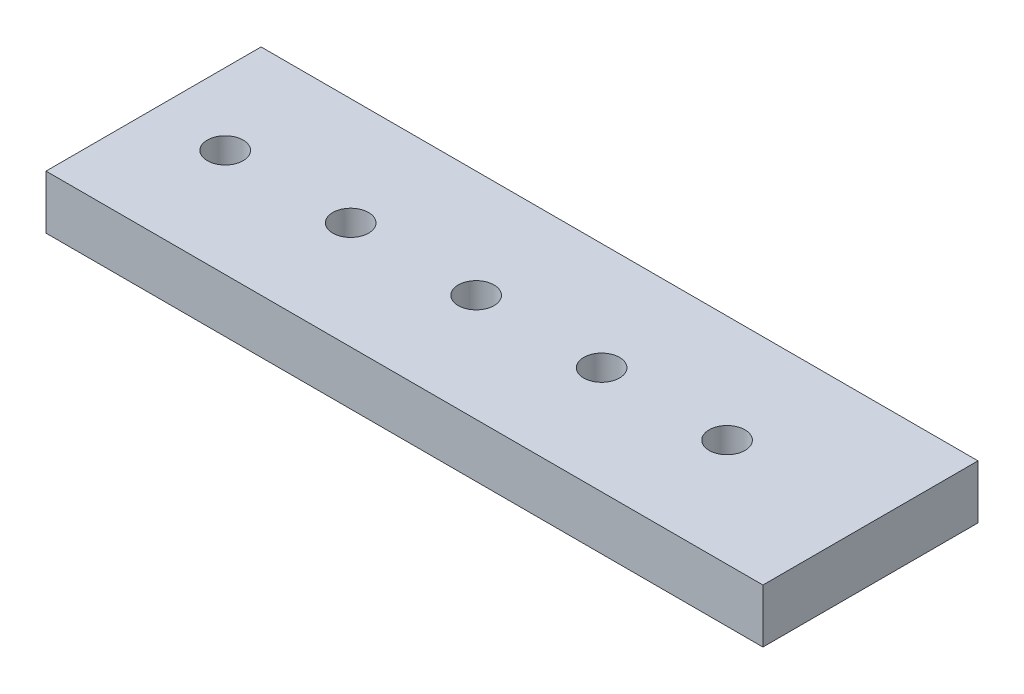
ISO-10303-21;
HEADER;
FILE_DESCRIPTION(('STEP AP214'),'2;1');
FILE_NAME('part.step','',(''),(''),'','','');
FILE_SCHEMA(('AUTOMOTIVE_DESIGN { 1 0 10303 214 1 1 1 1 }'));
ENDSEC;
DATA;
#1=APPLICATION_CONTEXT('core data for automotive mechanical design processes');
#2=APPLICATION_PROTOCOL_DEFINITION('international standard','automotive_design',2000,#1);
#3=PRODUCT_CONTEXT('',#1,'mechanical');
#4=PRODUCT('Part','Part','',(#3));
#5=PRODUCT_RELATED_PRODUCT_CATEGORY('part','',(#4));
#6=PRODUCT_DEFINITION_FORMATION('','',#4);
#7=PRODUCT_DEFINITION_CONTEXT('part definition',#1,'design');
#8=PRODUCT_DEFINITION('design','',#6,#7);
#9=PRODUCT_DEFINITION_SHAPE('','',#8);
#10=(LENGTH_UNIT() NAMED_UNIT(*) SI_UNIT(.MILLI.,.METRE.));
#11=(NAMED_UNIT(*) PLANE_ANGLE_UNIT() SI_UNIT($,.RADIAN.));
#12=(NAMED_UNIT(*) SI_UNIT($,.STERADIAN.) SOLID_ANGLE_UNIT());
#13=UNCERTAINTY_MEASURE_WITH_UNIT(LENGTH_MEASURE(1.E-05),#10,'distance_accuracy_value','');
#14=(GEOMETRIC_REPRESENTATION_CONTEXT(3) GLOBAL_UNCERTAINTY_ASSIGNED_CONTEXT((#13)) GLOBAL_UNIT_ASSIGNED_CONTEXT((#10,
#11,#12)) REPRESENTATION_CONTEXT('',''));
#15=CARTESIAN_POINT('',(0.,0.,0.));
#16=DIRECTION('',(0.,0.,1.));
#17=DIRECTION('',(1.,0.,0.));
#18=AXIS2_PLACEMENT_3D('',#15,#16,#17);
#19=CARTESIAN_POINT('',(160.,-15.,-30.));
#20=DIRECTION('',(0.,1.,0.));
#21=DIRECTION('',(0.,0.,1.));
#22=AXIS2_PLACEMENT_3D('',#19,#20,#21);
#23=CYLINDRICAL_SURFACE('',#22,5.);
#24=CARTESIAN_POINT('',(160.,-15.,-30.));
#25=DIRECTION('',(0.,1.,0.));
#26=DIRECTION('',(0.,0.,1.));
#27=AXIS2_PLACEMENT_3D('',#24,#25,#26);
#28=CIRCLE('',#27,5.);
#29=CARTESIAN_POINT('',(160.,-15.,-25.));
#30=VERTEX_POINT('',#29);
#31=EDGE_CURVE('E47',#30,#30,#28,.T.);
#32=ORIENTED_EDGE('',*,*,#31,.F.);
#33=EDGE_LOOP('',(#32));
#34=FACE_BOUND('',#33,.T.);
#35=CARTESIAN_POINT('',(160.,0.,-30.));
#36=DIRECTION('',(0.,1.,0.));
#37=DIRECTION('',(0.,0.,1.));
#38=AXIS2_PLACEMENT_3D('',#35,#36,#37);
#39=CIRCLE('',#38,5.);
#40=CARTESIAN_POINT('',(160.,0.,-25.));
#41=VERTEX_POINT('',#40);
#42=EDGE_CURVE('E11',#41,#41,#39,.T.);
#43=ORIENTED_EDGE('',*,*,#42,.T.);
#44=EDGE_LOOP('',(#43));
#45=FACE_BOUND('',#44,.T.);
#46=ADVANCED_FACE('F41',(#34,#45),#23,.F.);
#47=CARTESIAN_POINT('',(125.,-15.,-30.));
#48=DIRECTION('',(0.,1.,0.));
#49=DIRECTION('',(0.,0.,1.));
#50=AXIS2_PLACEMENT_3D('',#47,#48,#49);
#51=CYLINDRICAL_SURFACE('',#50,5.);
#52=CARTESIAN_POINT('',(125.,-15.,-30.));
#53=DIRECTION('',(0.,1.,0.));
#54=DIRECTION('',(0.,0.,1.));
#55=AXIS2_PLACEMENT_3D('',#52,#53,#54);
#56=CIRCLE('',#55,5.);
#57=CARTESIAN_POINT('',(125.,-15.,-25.));
#58=VERTEX_POINT('',#57);
#59=EDGE_CURVE('E126',#58,#58,#56,.T.);
#60=ORIENTED_EDGE('',*,*,#59,.F.);
#61=EDGE_LOOP('',(#60));
#62=FACE_BOUND('',#61,.T.);
#63=CARTESIAN_POINT('',(125.,0.,-30.));
#64=DIRECTION('',(0.,1.,0.));
#65=DIRECTION('',(0.,0.,1.));
#66=AXIS2_PLACEMENT_3D('',#63,#64,#65);
#67=CIRCLE('',#66,5.);
#68=CARTESIAN_POINT('',(125.,0.,-25.));
#69=VERTEX_POINT('',#68);
#70=EDGE_CURVE('E133',#69,#69,#67,.T.);
#71=ORIENTED_EDGE('',*,*,#70,.T.);
#72=EDGE_LOOP('',(#71));
#73=FACE_BOUND('',#72,.T.);
#74=ADVANCED_FACE('F138',(#62,#73),#51,.F.);
#75=CARTESIAN_POINT('',(90.,-15.,-30.));
#76=DIRECTION('',(0.,1.,0.));
#77=DIRECTION('',(0.,0.,1.));
#78=AXIS2_PLACEMENT_3D('',#75,#76,#77);
#79=CYLINDRICAL_SURFACE('',#78,5.);
#80=CARTESIAN_POINT('',(90.,-15.,-30.));
#81=DIRECTION('',(0.,1.,0.));
#82=DIRECTION('',(0.,0.,1.));
#83=AXIS2_PLACEMENT_3D('',#80,#81,#82);
#84=CIRCLE('',#83,5.);
#85=CARTESIAN_POINT('',(90.,-15.,-25.));
#86=VERTEX_POINT('',#85);
#87=EDGE_CURVE('E116',#86,#86,#84,.T.);
#88=ORIENTED_EDGE('',*,*,#87,.F.);
#89=EDGE_LOOP('',(#88));
#90=FACE_BOUND('',#89,.T.);
#91=CARTESIAN_POINT('',(90.,0.,-30.));
#92=DIRECTION('',(0.,1.,0.));
#93=DIRECTION('',(0.,0.,1.));
#94=AXIS2_PLACEMENT_3D('',#91,#92,#93);
#95=CIRCLE('',#94,5.);
#96=CARTESIAN_POINT('',(90.,0.,-25.));
#97=VERTEX_POINT('',#96);
#98=EDGE_CURVE('E122',#97,#97,#95,.T.);
#99=ORIENTED_EDGE('',*,*,#98,.T.);
#100=EDGE_LOOP('',(#99));
#101=FACE_BOUND('',#100,.T.);
#102=ADVANCED_FACE('F168',(#90,#101),#79,.F.);
#103=CARTESIAN_POINT('',(0.,-15.,0.));
#104=DIRECTION('',(-1.,0.,0.));
#105=DIRECTION('',(0.,0.,1.));
#106=AXIS2_PLACEMENT_3D('',#103,#104,#105);
#107=PLANE('',#106);
#108=DIRECTION('',(0.,0.,1.));
#109=VECTOR('',#108,1.);
#110=CARTESIAN_POINT('',(0.,0.,0.));
#111=LINE('',#110,#109);
#112=CARTESIAN_POINT('',(0.,0.,-60.));
#113=VERTEX_POINT('',#112);
#114=CARTESIAN_POINT('',(0.,0.,0.));
#115=VERTEX_POINT('',#114);
#116=EDGE_CURVE('E109',#113,#115,#111,.T.);
#117=ORIENTED_EDGE('',*,*,#116,.F.);
#118=DIRECTION('',(0.,1.,0.));
#119=VECTOR('',#118,1.);
#120=CARTESIAN_POINT('',(0.,-15.,-60.));
#121=LINE('',#120,#119);
#122=CARTESIAN_POINT('',(0.,-15.,-60.));
#123=VERTEX_POINT('',#122);
#124=EDGE_CURVE('E60',#123,#113,#121,.T.);
#125=ORIENTED_EDGE('',*,*,#124,.F.);
#126=DIRECTION('',(0.,0.,1.));
#127=VECTOR('',#126,1.);
#128=CARTESIAN_POINT('',(0.,-15.,0.));
#129=LINE('',#128,#127);
#130=CARTESIAN_POINT('',(0.,-15.,0.));
#131=VERTEX_POINT('',#130);
#132=EDGE_CURVE('E103',#123,#131,#129,.T.);
#133=ORIENTED_EDGE('',*,*,#132,.T.);
#134=DIRECTION('',(0.,1.,0.));
#135=VECTOR('',#134,1.);
#136=CARTESIAN_POINT('',(0.,-15.,0.));
#137=LINE('',#136,#135);
#138=EDGE_CURVE('E82',#131,#115,#137,.T.);
#139=ORIENTED_EDGE('',*,*,#138,.T.);
#140=EDGE_LOOP('',(#117,#125,#133,#139));
#141=FACE_BOUND('',#140,.T.);
#142=ADVANCED_FACE('F162',(#141),#107,.T.);
#143=CARTESIAN_POINT('',(0.,-15.,-60.));
#144=DIRECTION('',(0.,0.,-1.));
#145=DIRECTION('',(-1.,0.,0.));
#146=AXIS2_PLACEMENT_3D('',#143,#144,#145);
#147=PLANE('',#146);
#148=DIRECTION('',(-1.,0.,0.));
#149=VECTOR('',#148,1.);
#150=CARTESIAN_POINT('',(0.,0.,-60.));
#151=LINE('',#150,#149);
#152=CARTESIAN_POINT('',(200.,0.,-60.));
#153=VERTEX_POINT('',#152);
#154=EDGE_CURVE('E104',#153,#113,#151,.T.);
#155=ORIENTED_EDGE('',*,*,#154,.F.);
#156=DIRECTION('',(0.,1.,0.));
#157=VECTOR('',#156,1.);
#158=CARTESIAN_POINT('',(200.,-15.,-60.));
#159=LINE('',#158,#157);
#160=CARTESIAN_POINT('',(200.,-15.,-60.));
#161=VERTEX_POINT('',#160);
#162=EDGE_CURVE('E74',#161,#153,#159,.T.);
#163=ORIENTED_EDGE('',*,*,#162,.F.);
#164=DIRECTION('',(-1.,0.,0.));
#165=VECTOR('',#164,1.);
#166=CARTESIAN_POINT('',(0.,-15.,-60.));
#167=LINE('',#166,#165);
#168=EDGE_CURVE('E99',#161,#123,#167,.T.);
#169=ORIENTED_EDGE('',*,*,#168,.T.);
#170=ORIENTED_EDGE('',*,*,#124,.T.);
#171=EDGE_LOOP('',(#155,#163,#169,#170));
#172=FACE_BOUND('',#171,.T.);
#173=ADVANCED_FACE('F159',(#172),#147,.T.);
#174=CARTESIAN_POINT('',(200.,-15.,0.));
#175=DIRECTION('',(1.,0.,0.));
#176=DIRECTION('',(0.,0.,-1.));
#177=AXIS2_PLACEMENT_3D('',#174,#175,#176);
#178=PLANE('',#177);
#179=DIRECTION('',(0.,0.,-1.));
#180=VECTOR('',#179,1.);
#181=CARTESIAN_POINT('',(200.,0.,0.));
#182=LINE('',#181,#180);
#183=CARTESIAN_POINT('',(200.,0.,0.));
#184=VERTEX_POINT('',#183);
#185=EDGE_CURVE('E91',#184,#153,#182,.T.);
#186=ORIENTED_EDGE('',*,*,#185,.F.);
#187=DIRECTION('',(0.,1.,0.));
#188=VECTOR('',#187,1.);
#189=CARTESIAN_POINT('',(200.,-15.,0.));
#190=LINE('',#189,#188);
#191=CARTESIAN_POINT('',(200.,-15.,0.));
#192=VERTEX_POINT('',#191);
#193=EDGE_CURVE('E86',#192,#184,#190,.T.);
#194=ORIENTED_EDGE('',*,*,#193,.F.);
#195=DIRECTION('',(0.,0.,-1.));
#196=VECTOR('',#195,1.);
#197=CARTESIAN_POINT('',(200.,-15.,0.));
#198=LINE('',#197,#196);
#199=EDGE_CURVE('E93',#192,#161,#198,.T.);
#200=ORIENTED_EDGE('',*,*,#199,.T.);
#201=ORIENTED_EDGE('',*,*,#162,.T.);
#202=EDGE_LOOP('',(#186,#194,#200,#201));
#203=FACE_BOUND('',#202,.T.);
#204=ADVANCED_FACE('F89',(#203),#178,.T.);
#205=CARTESIAN_POINT('',(0.,-15.,0.));
#206=DIRECTION('',(0.,0.,1.));
#207=DIRECTION('',(1.,0.,0.));
#208=AXIS2_PLACEMENT_3D('',#205,#206,#207);
#209=PLANE('',#208);
#210=DIRECTION('',(1.,0.,0.));
#211=VECTOR('',#210,1.);
#212=CARTESIAN_POINT('',(0.,0.,0.));
#213=LINE('',#212,#211);
#214=EDGE_CURVE('E114',#115,#184,#213,.T.);
#215=ORIENTED_EDGE('',*,*,#214,.F.);
#216=ORIENTED_EDGE('',*,*,#138,.F.);
#217=DIRECTION('',(1.,0.,0.));
#218=VECTOR('',#217,1.);
#219=CARTESIAN_POINT('',(0.,-15.,0.));
#220=LINE('',#219,#218);
#221=EDGE_CURVE('E97',#131,#192,#220,.T.);
#222=ORIENTED_EDGE('',*,*,#221,.T.);
#223=ORIENTED_EDGE('',*,*,#193,.T.);
#224=EDGE_LOOP('',(#215,#216,#222,#223));
#225=FACE_BOUND('',#224,.T.);
#226=ADVANCED_FACE('F105',(#225),#209,.T.);
#227=CARTESIAN_POINT('',(0.,-15.,0.));
#228=DIRECTION('',(0.,-1.,0.));
#229=DIRECTION('',(0.,0.,-1.));
#230=AXIS2_PLACEMENT_3D('',#227,#228,#229);
#231=PLANE('',#230);
#232=CARTESIAN_POINT('',(55.,-15.,-30.));
#233=DIRECTION('',(0.,1.,0.));
#234=DIRECTION('',(0.,0.,1.));
#235=AXIS2_PLACEMENT_3D('',#232,#233,#234);
#236=CIRCLE('',#235,5.);
#237=CARTESIAN_POINT('',(55.,-15.,-25.));
#238=VERTEX_POINT('',#237);
#239=EDGE_CURVE('E226',#238,#238,#236,.T.);
#240=ORIENTED_EDGE('',*,*,#239,.T.);
#241=EDGE_LOOP('',(#240));
#242=FACE_BOUND('',#241,.T.);
#243=CARTESIAN_POINT('',(20.,-15.,-30.));
#244=DIRECTION('',(0.,1.,0.));
#245=DIRECTION('',(0.,0.,1.));
#246=AXIS2_PLACEMENT_3D('',#243,#244,#245);
#247=CIRCLE('',#246,5.);
#248=CARTESIAN_POINT('',(20.,-15.,-25.));
#249=VERTEX_POINT('',#248);
#250=EDGE_CURVE('E111',#249,#249,#247,.T.);
#251=ORIENTED_EDGE('',*,*,#250,.T.);
#252=EDGE_LOOP('',(#251));
#253=FACE_BOUND('',#252,.T.);
#254=ORIENTED_EDGE('',*,*,#132,.F.);
#255=ORIENTED_EDGE('',*,*,#168,.F.);
#256=ORIENTED_EDGE('',*,*,#199,.F.);
#257=ORIENTED_EDGE('',*,*,#221,.F.);
#258=EDGE_LOOP('',(#254,#255,#256,#257));
#259=FACE_BOUND('',#258,.T.);
#260=ORIENTED_EDGE('',*,*,#87,.T.);
#261=EDGE_LOOP('',(#260));
#262=FACE_BOUND('',#261,.T.);
#263=ORIENTED_EDGE('',*,*,#59,.T.);
#264=EDGE_LOOP('',(#263));
#265=FACE_BOUND('',#264,.T.);
#266=ORIENTED_EDGE('',*,*,#31,.T.);
#267=EDGE_LOOP('',(#266));
#268=FACE_BOUND('',#267,.T.);
#269=ADVANCED_FACE('F100',(#242,#253,#259,#262,#265,#268),#231,.T.);
#270=CARTESIAN_POINT('',(0.,0.,0.));
#271=DIRECTION('',(0.,-1.,0.));
#272=DIRECTION('',(0.,0.,-1.));
#273=AXIS2_PLACEMENT_3D('',#270,#271,#272);
#274=PLANE('',#273);
#275=CARTESIAN_POINT('',(55.,0.,-30.));
#276=DIRECTION('',(0.,1.,0.));
#277=DIRECTION('',(0.,0.,1.));
#278=AXIS2_PLACEMENT_3D('',#275,#276,#277);
#279=CIRCLE('',#278,5.);
#280=CARTESIAN_POINT('',(55.,0.,-25.));
#281=VERTEX_POINT('',#280);
#282=EDGE_CURVE('E231',#281,#281,#279,.T.);
#283=ORIENTED_EDGE('',*,*,#282,.F.);
#284=EDGE_LOOP('',(#283));
#285=FACE_BOUND('',#284,.T.);
#286=CARTESIAN_POINT('',(20.,0.,-30.));
#287=DIRECTION('',(0.,1.,0.));
#288=DIRECTION('',(0.,0.,1.));
#289=AXIS2_PLACEMENT_3D('',#286,#287,#288);
#290=CIRCLE('',#289,5.);
#291=CARTESIAN_POINT('',(20.,0.,-25.));
#292=VERTEX_POINT('',#291);
#293=EDGE_CURVE('E235',#292,#292,#290,.T.);
#294=ORIENTED_EDGE('',*,*,#293,.F.);
#295=EDGE_LOOP('',(#294));
#296=FACE_BOUND('',#295,.T.);
#297=ORIENTED_EDGE('',*,*,#116,.T.);
#298=ORIENTED_EDGE('',*,*,#214,.T.);
#299=ORIENTED_EDGE('',*,*,#185,.T.);
#300=ORIENTED_EDGE('',*,*,#154,.T.);
#301=EDGE_LOOP('',(#297,#298,#299,#300));
#302=FACE_BOUND('',#301,.T.);
#303=ORIENTED_EDGE('',*,*,#98,.F.);
#304=EDGE_LOOP('',(#303));
#305=FACE_BOUND('',#304,.T.);
#306=ORIENTED_EDGE('',*,*,#70,.F.);
#307=EDGE_LOOP('',(#306));
#308=FACE_BOUND('',#307,.T.);
#309=ORIENTED_EDGE('',*,*,#42,.F.);
#310=EDGE_LOOP('',(#309));
#311=FACE_BOUND('',#310,.T.);
#312=ADVANCED_FACE('F142',(#285,#296,#302,#305,#308,#311),#274,.F.);
#313=CARTESIAN_POINT('',(20.,-15.,-30.));
#314=DIRECTION('',(0.,1.,0.));
#315=DIRECTION('',(0.,0.,1.));
#316=AXIS2_PLACEMENT_3D('',#313,#314,#315);
#317=CYLINDRICAL_SURFACE('',#316,5.);
#318=ORIENTED_EDGE('',*,*,#250,.F.);
#319=EDGE_LOOP('',(#318));
#320=FACE_BOUND('',#319,.T.);
#321=ORIENTED_EDGE('',*,*,#293,.T.);
#322=EDGE_LOOP('',(#321));
#323=FACE_BOUND('',#322,.T.);
#324=ADVANCED_FACE('F145',(#320,#323),#317,.F.);
#325=CARTESIAN_POINT('',(55.,-15.,-30.));
#326=DIRECTION('',(0.,1.,0.));
#327=DIRECTION('',(0.,0.,1.));
#328=AXIS2_PLACEMENT_3D('',#325,#326,#327);
#329=CYLINDRICAL_SURFACE('',#328,5.);
#330=ORIENTED_EDGE('',*,*,#239,.F.);
#331=EDGE_LOOP('',(#330));
#332=FACE_BOUND('',#331,.T.);
#333=ORIENTED_EDGE('',*,*,#282,.T.);
#334=EDGE_LOOP('',(#333));
#335=FACE_BOUND('',#334,.T.);
#336=ADVANCED_FACE('F155',(#332,#335),#329,.F.);
#337=CLOSED_SHELL('',(#46,#74,#102,#142,#173,#204,#226,#269,#312,#324,#336));
#338=MANIFOLD_SOLID_BREP('B2',#337);
#339=ADVANCED_BREP_SHAPE_REPRESENTATION('',(#18,#338),#14);
#340=SHAPE_DEFINITION_REPRESENTATION(#9,#339);
ENDSEC;
END-ISO-10303-21;
